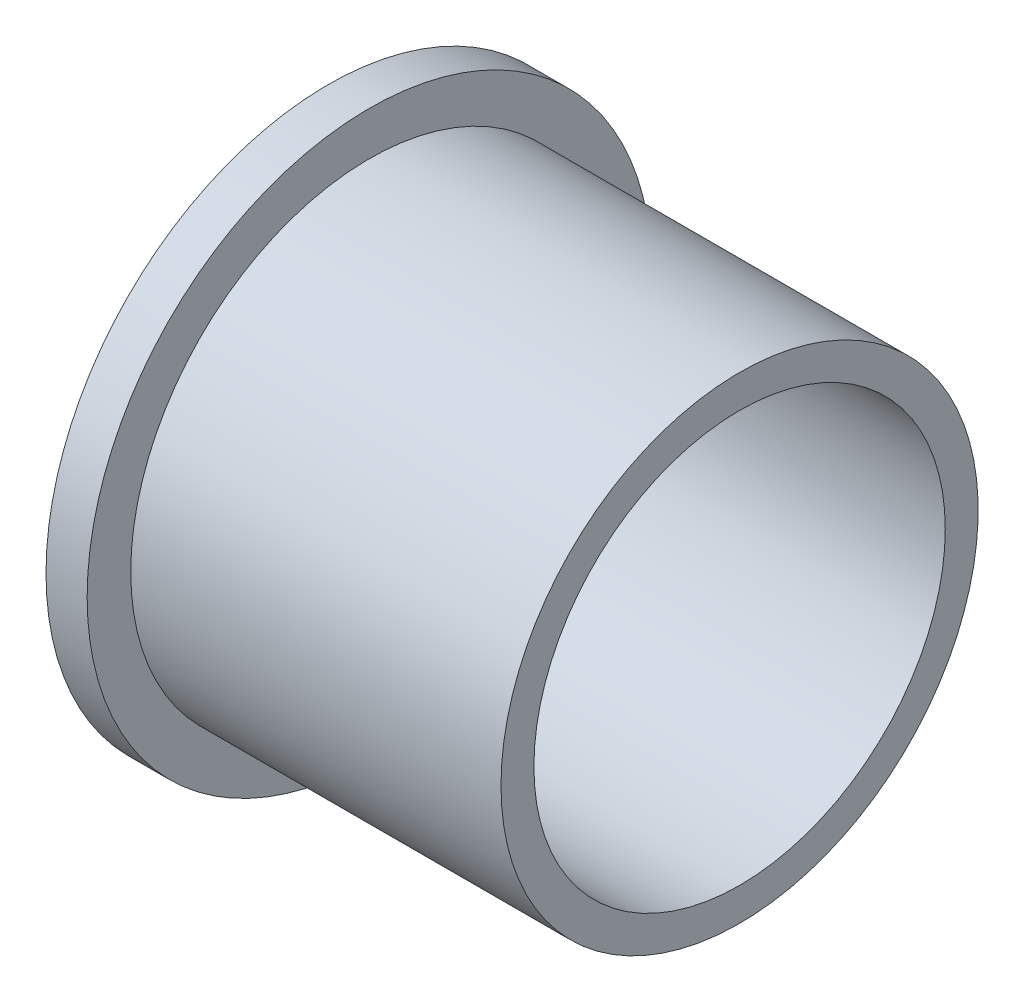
ISO-10303-21;
HEADER;
FILE_DESCRIPTION(('STEP AP214'),'2;1');
FILE_NAME('part.step','',(''),(''),'','','');
FILE_SCHEMA(('AUTOMOTIVE_DESIGN { 1 0 10303 214 1 1 1 1 }'));
ENDSEC;
DATA;
#1=APPLICATION_CONTEXT('core data for automotive mechanical design processes');
#2=APPLICATION_PROTOCOL_DEFINITION('international standard','automotive_design',2000,#1);
#3=PRODUCT_CONTEXT('',#1,'mechanical');
#4=PRODUCT('Part','Part','',(#3));
#5=PRODUCT_RELATED_PRODUCT_CATEGORY('part','',(#4));
#6=PRODUCT_DEFINITION_FORMATION('','',#4);
#7=PRODUCT_DEFINITION_CONTEXT('part definition',#1,'design');
#8=PRODUCT_DEFINITION('design','',#6,#7);
#9=PRODUCT_DEFINITION_SHAPE('','',#8);
#10=(LENGTH_UNIT() NAMED_UNIT(*) SI_UNIT(.MILLI.,.METRE.));
#11=(NAMED_UNIT(*) PLANE_ANGLE_UNIT() SI_UNIT($,.RADIAN.));
#12=(NAMED_UNIT(*) SI_UNIT($,.STERADIAN.) SOLID_ANGLE_UNIT());
#13=UNCERTAINTY_MEASURE_WITH_UNIT(LENGTH_MEASURE(1.E-05),#10,'distance_accuracy_value','');
#14=(GEOMETRIC_REPRESENTATION_CONTEXT(3) GLOBAL_UNCERTAINTY_ASSIGNED_CONTEXT((#13)) GLOBAL_UNIT_ASSIGNED_CONTEXT((#10,
#11,#12)) REPRESENTATION_CONTEXT('',''));
#15=CARTESIAN_POINT('',(0.,0.,0.));
#16=DIRECTION('',(0.,0.,1.));
#17=DIRECTION('',(1.,0.,0.));
#18=AXIS2_PLACEMENT_3D('',#15,#16,#17);
#19=CARTESIAN_POINT('',(0.,0.,0.));
#20=DIRECTION('',(-1.,0.,0.));
#21=DIRECTION('',(0.,0.,1.));
#22=AXIS2_PLACEMENT_3D('',#19,#20,#21);
#23=CYLINDRICAL_SURFACE('',#22,25.);
#24=CARTESIAN_POINT('',(0.,0.,0.));
#25=DIRECTION('',(-1.,0.,0.));
#26=DIRECTION('',(0.,0.,1.));
#27=AXIS2_PLACEMENT_3D('',#24,#25,#26);
#28=CIRCLE('',#27,25.);
#29=CARTESIAN_POINT('',(0.,0.,25.));
#30=VERTEX_POINT('',#29);
#31=EDGE_CURVE('E54',#30,#30,#28,.T.);
#32=ORIENTED_EDGE('',*,*,#31,.T.);
#33=EDGE_LOOP('',(#32));
#34=FACE_BOUND('',#33,.T.);
#35=CARTESIAN_POINT('',(50.,0.,0.));
#36=DIRECTION('',(-1.,0.,0.));
#37=DIRECTION('',(0.,0.,1.));
#38=AXIS2_PLACEMENT_3D('',#35,#36,#37);
#39=CIRCLE('',#38,25.);
#40=CARTESIAN_POINT('',(50.,0.,25.));
#41=VERTEX_POINT('',#40);
#42=EDGE_CURVE('E10',#41,#41,#39,.T.);
#43=ORIENTED_EDGE('',*,*,#42,.F.);
#44=EDGE_LOOP('',(#43));
#45=FACE_BOUND('',#44,.T.);
#46=ADVANCED_FACE('F32',(#34,#45),#23,.F.);
#47=CARTESIAN_POINT('',(50.,-29.,0.));
#48=DIRECTION('',(1.,0.,0.));
#49=DIRECTION('',(0.,0.,-1.));
#50=AXIS2_PLACEMENT_3D('',#47,#48,#49);
#51=PLANE('',#50);
#52=ORIENTED_EDGE('',*,*,#42,.T.);
#53=EDGE_LOOP('',(#52));
#54=FACE_BOUND('',#53,.T.);
#55=CARTESIAN_POINT('',(50.,0.,0.));
#56=DIRECTION('',(-1.,0.,0.));
#57=DIRECTION('',(0.,0.,1.));
#58=AXIS2_PLACEMENT_3D('',#55,#56,#57);
#59=CIRCLE('',#58,29.);
#60=CARTESIAN_POINT('',(50.,0.,29.));
#61=VERTEX_POINT('',#60);
#62=EDGE_CURVE('E38',#61,#61,#59,.T.);
#63=ORIENTED_EDGE('',*,*,#62,.F.);
#64=EDGE_LOOP('',(#63));
#65=FACE_BOUND('',#64,.T.);
#66=ADVANCED_FACE('F72',(#54,#65),#51,.T.);
#67=CARTESIAN_POINT('',(0.,0.,0.));
#68=DIRECTION('',(-1.,0.,0.));
#69=DIRECTION('',(0.,0.,1.));
#70=AXIS2_PLACEMENT_3D('',#67,#68,#69);
#71=CYLINDRICAL_SURFACE('',#70,29.);
#72=ORIENTED_EDGE('',*,*,#62,.T.);
#73=EDGE_LOOP('',(#72));
#74=FACE_BOUND('',#73,.T.);
#75=CARTESIAN_POINT('',(5.,0.,0.));
#76=DIRECTION('',(-1.,0.,0.));
#77=DIRECTION('',(0.,0.,1.));
#78=AXIS2_PLACEMENT_3D('',#75,#76,#77);
#79=CIRCLE('',#78,29.);
#80=CARTESIAN_POINT('',(5.,0.,29.));
#81=VERTEX_POINT('',#80);
#82=EDGE_CURVE('E42',#81,#81,#79,.T.);
#83=ORIENTED_EDGE('',*,*,#82,.F.);
#84=EDGE_LOOP('',(#83));
#85=FACE_BOUND('',#84,.T.);
#86=ADVANCED_FACE('F76',(#74,#85),#71,.T.);
#87=CARTESIAN_POINT('',(5.,-34.3,0.));
#88=DIRECTION('',(1.,0.,0.));
#89=DIRECTION('',(0.,0.,-1.));
#90=AXIS2_PLACEMENT_3D('',#87,#88,#89);
#91=PLANE('',#90);
#92=ORIENTED_EDGE('',*,*,#82,.T.);
#93=EDGE_LOOP('',(#92));
#94=FACE_BOUND('',#93,.T.);
#95=CARTESIAN_POINT('',(5.,0.,0.));
#96=DIRECTION('',(-1.,0.,0.));
#97=DIRECTION('',(0.,0.,1.));
#98=AXIS2_PLACEMENT_3D('',#95,#96,#97);
#99=CIRCLE('',#98,34.3);
#100=CARTESIAN_POINT('',(5.,0.,34.3));
#101=VERTEX_POINT('',#100);
#102=EDGE_CURVE('E46',#101,#101,#99,.T.);
#103=ORIENTED_EDGE('',*,*,#102,.F.);
#104=EDGE_LOOP('',(#103));
#105=FACE_BOUND('',#104,.T.);
#106=ADVANCED_FACE('F68',(#94,#105),#91,.T.);
#107=CARTESIAN_POINT('',(0.,0.,0.));
#108=DIRECTION('',(-1.,0.,0.));
#109=DIRECTION('',(0.,0.,1.));
#110=AXIS2_PLACEMENT_3D('',#107,#108,#109);
#111=CYLINDRICAL_SURFACE('',#110,34.3);
#112=ORIENTED_EDGE('',*,*,#102,.T.);
#113=EDGE_LOOP('',(#112));
#114=FACE_BOUND('',#113,.T.);
#115=CARTESIAN_POINT('',(0.,0.,0.));
#116=DIRECTION('',(-1.,0.,0.));
#117=DIRECTION('',(0.,0.,1.));
#118=AXIS2_PLACEMENT_3D('',#115,#116,#117);
#119=CIRCLE('',#118,34.3);
#120=CARTESIAN_POINT('',(0.,0.,34.3));
#121=VERTEX_POINT('',#120);
#122=EDGE_CURVE('E51',#121,#121,#119,.T.);
#123=ORIENTED_EDGE('',*,*,#122,.F.);
#124=EDGE_LOOP('',(#123));
#125=FACE_BOUND('',#124,.T.);
#126=ADVANCED_FACE('F62',(#114,#125),#111,.T.);
#127=CARTESIAN_POINT('',(0.,-25.,0.));
#128=DIRECTION('',(-1.,0.,0.));
#129=DIRECTION('',(0.,0.,1.));
#130=AXIS2_PLACEMENT_3D('',#127,#128,#129);
#131=PLANE('',#130);
#132=ORIENTED_EDGE('',*,*,#122,.T.);
#133=EDGE_LOOP('',(#132));
#134=FACE_BOUND('',#133,.T.);
#135=ORIENTED_EDGE('',*,*,#31,.F.);
#136=EDGE_LOOP('',(#135));
#137=FACE_BOUND('',#136,.T.);
#138=ADVANCED_FACE('F60',(#134,#137),#131,.T.);
#139=CLOSED_SHELL('',(#46,#66,#86,#106,#126,#138));
#140=MANIFOLD_SOLID_BREP('B2',#139);
#141=ADVANCED_BREP_SHAPE_REPRESENTATION('',(#18,#140),#14);
#142=SHAPE_DEFINITION_REPRESENTATION(#9,#141);
ENDSEC;
END-ISO-10303-21;
